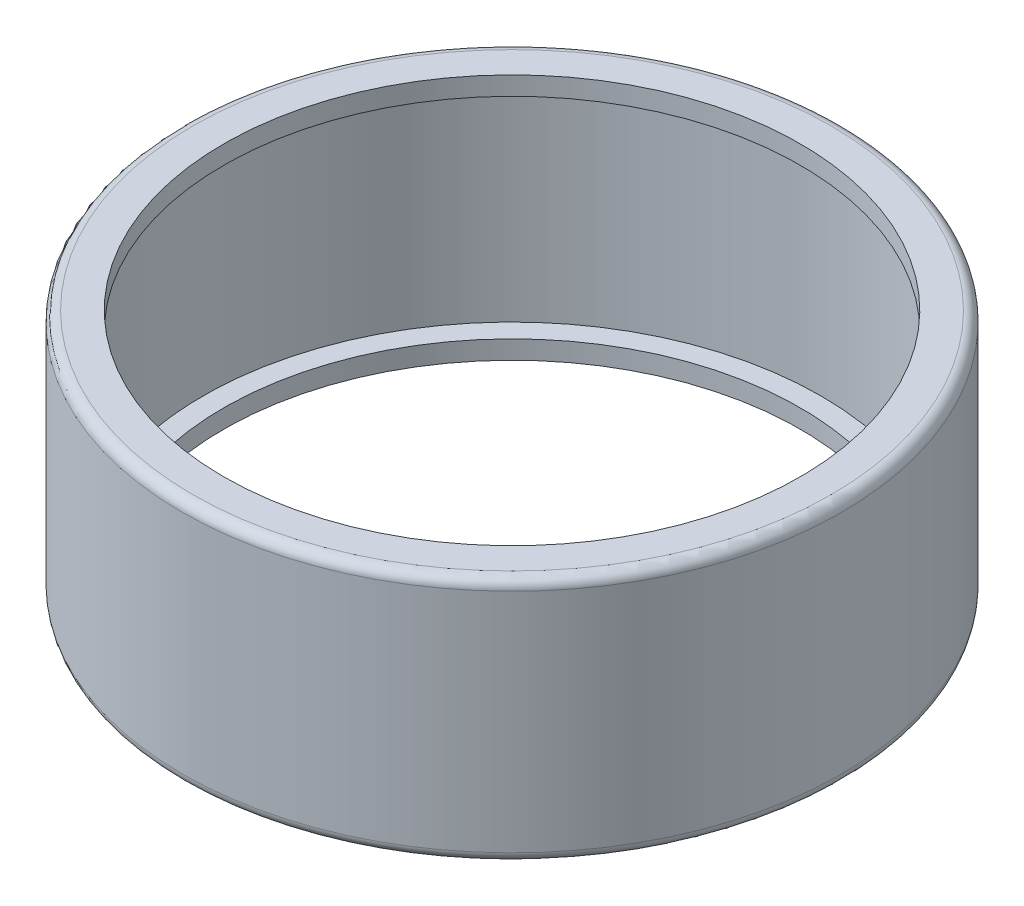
ISO-10303-21;
HEADER;
FILE_DESCRIPTION(('STEP AP214'),'2;1');
FILE_NAME('part.step','',(''),(''),'','','');
FILE_SCHEMA(('AUTOMOTIVE_DESIGN { 1 0 10303 214 1 1 1 1 }'));
ENDSEC;
DATA;
#1=APPLICATION_CONTEXT('core data for automotive mechanical design processes');
#2=APPLICATION_PROTOCOL_DEFINITION('international standard','automotive_design',2000,#1);
#3=PRODUCT_CONTEXT('',#1,'mechanical');
#4=PRODUCT('Part','Part','',(#3));
#5=PRODUCT_RELATED_PRODUCT_CATEGORY('part','',(#4));
#6=PRODUCT_DEFINITION_FORMATION('','',#4);
#7=PRODUCT_DEFINITION_CONTEXT('part definition',#1,'design');
#8=PRODUCT_DEFINITION('design','',#6,#7);
#9=PRODUCT_DEFINITION_SHAPE('','',#8);
#10=(LENGTH_UNIT() NAMED_UNIT(*) SI_UNIT(.MILLI.,.METRE.));
#11=(NAMED_UNIT(*) PLANE_ANGLE_UNIT() SI_UNIT($,.RADIAN.));
#12=(NAMED_UNIT(*) SI_UNIT($,.STERADIAN.) SOLID_ANGLE_UNIT());
#13=UNCERTAINTY_MEASURE_WITH_UNIT(LENGTH_MEASURE(1.E-05),#10,'distance_accuracy_value','');
#14=(GEOMETRIC_REPRESENTATION_CONTEXT(3) GLOBAL_UNCERTAINTY_ASSIGNED_CONTEXT((#13)) GLOBAL_UNIT_ASSIGNED_CONTEXT((#10,
#11,#12)) REPRESENTATION_CONTEXT('',''));
#15=CARTESIAN_POINT('',(0.,0.,0.));
#16=DIRECTION('',(0.,0.,1.));
#17=DIRECTION('',(1.,0.,0.));
#18=AXIS2_PLACEMENT_3D('',#15,#16,#17);
#19=CARTESIAN_POINT('',(-15.5,-6.,0.));
#20=DIRECTION('',(0.,-1.,0.));
#21=DIRECTION('',(0.,0.,-1.));
#22=AXIS2_PLACEMENT_3D('',#19,#20,#21);
#23=PLANE('',#22);
#24=CARTESIAN_POINT('',(0.,-6.,0.));
#25=DIRECTION('',(0.,1.,0.));
#26=DIRECTION('',(0.,0.,1.));
#27=AXIS2_PLACEMENT_3D('',#24,#25,#26);
#28=CIRCLE('',#27,14.);
#29=CARTESIAN_POINT('',(0.,-6.,14.));
#30=VERTEX_POINT('',#29);
#31=EDGE_CURVE('E11',#30,#30,#28,.T.);
#32=ORIENTED_EDGE('',*,*,#31,.T.);
#33=EDGE_LOOP('',(#32));
#34=FACE_BOUND('',#33,.T.);
#35=CARTESIAN_POINT('',(0.,-6.,0.));
#36=DIRECTION('',(0.,1.,0.));
#37=DIRECTION('',(0.,0.,1.));
#38=AXIS2_PLACEMENT_3D('',#35,#36,#37);
#39=CIRCLE('',#38,15.5);
#40=CARTESIAN_POINT('',(0.,-6.,15.5));
#41=VERTEX_POINT('',#40);
#42=EDGE_CURVE('E387',#41,#41,#39,.T.);
#43=ORIENTED_EDGE('',*,*,#42,.F.);
#44=EDGE_LOOP('',(#43));
#45=FACE_BOUND('',#44,.T.);
#46=ADVANCED_FACE('F352',(#34,#45),#23,.T.);
#47=CARTESIAN_POINT('',(0.,7.,0.));
#48=DIRECTION('',(0.,1.,0.));
#49=DIRECTION('',(0.,0.,1.));
#50=AXIS2_PLACEMENT_3D('',#47,#48,#49);
#51=CYLINDRICAL_SURFACE('',#50,14.);
#52=CARTESIAN_POINT('',(0.,-5.1,0.));
#53=DIRECTION('',(0.,1.,0.));
#54=DIRECTION('',(0.,0.,1.));
#55=AXIS2_PLACEMENT_3D('',#52,#53,#54);
#56=CIRCLE('',#55,14.);
#57=CARTESIAN_POINT('',(0.,-5.1,14.));
#58=VERTEX_POINT('',#57);
#59=EDGE_CURVE('E358',#58,#58,#56,.T.);
#60=ORIENTED_EDGE('',*,*,#59,.T.);
#61=EDGE_LOOP('',(#60));
#62=FACE_BOUND('',#61,.T.);
#63=ORIENTED_EDGE('',*,*,#31,.F.);
#64=EDGE_LOOP('',(#63));
#65=FACE_BOUND('',#64,.T.);
#66=ADVANCED_FACE('F396',(#62,#65),#51,.F.);
#67=CARTESIAN_POINT('',(-14.,-5.1,0.));
#68=DIRECTION('',(0.,1.,0.));
#69=DIRECTION('',(0.,0.,1.));
#70=AXIS2_PLACEMENT_3D('',#67,#68,#69);
#71=PLANE('',#70);
#72=CARTESIAN_POINT('',(0.,-5.1,0.));
#73=DIRECTION('',(0.,1.,0.));
#74=DIRECTION('',(0.,0.,1.));
#75=AXIS2_PLACEMENT_3D('',#72,#73,#74);
#76=CIRCLE('',#75,15.);
#77=CARTESIAN_POINT('',(0.,-5.1,15.));
#78=VERTEX_POINT('',#77);
#79=EDGE_CURVE('E362',#78,#78,#76,.T.);
#80=ORIENTED_EDGE('',*,*,#79,.T.);
#81=EDGE_LOOP('',(#80));
#82=FACE_BOUND('',#81,.T.);
#83=ORIENTED_EDGE('',*,*,#59,.F.);
#84=EDGE_LOOP('',(#83));
#85=FACE_BOUND('',#84,.T.);
#86=ADVANCED_FACE('F400',(#82,#85),#71,.T.);
#87=CARTESIAN_POINT('',(0.,7.,0.));
#88=DIRECTION('',(0.,1.,0.));
#89=DIRECTION('',(0.,0.,1.));
#90=AXIS2_PLACEMENT_3D('',#87,#88,#89);
#91=CYLINDRICAL_SURFACE('',#90,15.);
#92=CARTESIAN_POINT('',(0.,5.1,0.));
#93=DIRECTION('',(0.,1.,0.));
#94=DIRECTION('',(0.,0.,1.));
#95=AXIS2_PLACEMENT_3D('',#92,#93,#94);
#96=CIRCLE('',#95,15.);
#97=CARTESIAN_POINT('',(0.,5.1,15.));
#98=VERTEX_POINT('',#97);
#99=EDGE_CURVE('E366',#98,#98,#96,.T.);
#100=ORIENTED_EDGE('',*,*,#99,.T.);
#101=EDGE_LOOP('',(#100));
#102=FACE_BOUND('',#101,.T.);
#103=ORIENTED_EDGE('',*,*,#79,.F.);
#104=EDGE_LOOP('',(#103));
#105=FACE_BOUND('',#104,.T.);
#106=ADVANCED_FACE('F404',(#102,#105),#91,.F.);
#107=CARTESIAN_POINT('',(-15.,5.1,0.));
#108=DIRECTION('',(0.,-1.,0.));
#109=DIRECTION('',(0.,0.,-1.));
#110=AXIS2_PLACEMENT_3D('',#107,#108,#109);
#111=PLANE('',#110);
#112=CARTESIAN_POINT('',(0.,5.1,0.));
#113=DIRECTION('',(0.,1.,0.));
#114=DIRECTION('',(0.,0.,1.));
#115=AXIS2_PLACEMENT_3D('',#112,#113,#114);
#116=CIRCLE('',#115,14.);
#117=CARTESIAN_POINT('',(0.,5.1,14.));
#118=VERTEX_POINT('',#117);
#119=EDGE_CURVE('E371',#118,#118,#116,.T.);
#120=ORIENTED_EDGE('',*,*,#119,.T.);
#121=EDGE_LOOP('',(#120));
#122=FACE_BOUND('',#121,.T.);
#123=ORIENTED_EDGE('',*,*,#99,.F.);
#124=EDGE_LOOP('',(#123));
#125=FACE_BOUND('',#124,.T.);
#126=ADVANCED_FACE('F411',(#122,#125),#111,.T.);
#127=CARTESIAN_POINT('',(0.,7.,0.));
#128=DIRECTION('',(0.,1.,0.));
#129=DIRECTION('',(0.,0.,1.));
#130=AXIS2_PLACEMENT_3D('',#127,#128,#129);
#131=CYLINDRICAL_SURFACE('',#130,14.);
#132=CARTESIAN_POINT('',(0.,6.,0.));
#133=DIRECTION('',(0.,1.,0.));
#134=DIRECTION('',(0.,0.,1.));
#135=AXIS2_PLACEMENT_3D('',#132,#133,#134);
#136=CIRCLE('',#135,14.);
#137=CARTESIAN_POINT('',(0.,6.,14.));
#138=VERTEX_POINT('',#137);
#139=EDGE_CURVE('E374',#138,#138,#136,.T.);
#140=ORIENTED_EDGE('',*,*,#139,.T.);
#141=EDGE_LOOP('',(#140));
#142=FACE_BOUND('',#141,.T.);
#143=ORIENTED_EDGE('',*,*,#119,.F.);
#144=EDGE_LOOP('',(#143));
#145=FACE_BOUND('',#144,.T.);
#146=ADVANCED_FACE('F415',(#142,#145),#131,.F.);
#147=CARTESIAN_POINT('',(-14.,6.,0.));
#148=DIRECTION('',(0.,1.,0.));
#149=DIRECTION('',(0.,0.,1.));
#150=AXIS2_PLACEMENT_3D('',#147,#148,#149);
#151=PLANE('',#150);
#152=CARTESIAN_POINT('',(0.,6.,0.));
#153=DIRECTION('',(0.,1.,0.));
#154=DIRECTION('',(0.,0.,1.));
#155=AXIS2_PLACEMENT_3D('',#152,#153,#154);
#156=CIRCLE('',#155,15.5);
#157=CARTESIAN_POINT('',(0.,6.,15.5));
#158=VERTEX_POINT('',#157);
#159=EDGE_CURVE('E377',#158,#158,#156,.T.);
#160=ORIENTED_EDGE('',*,*,#159,.T.);
#161=EDGE_LOOP('',(#160));
#162=FACE_BOUND('',#161,.T.);
#163=ORIENTED_EDGE('',*,*,#139,.F.);
#164=EDGE_LOOP('',(#163));
#165=FACE_BOUND('',#164,.T.);
#166=ADVANCED_FACE('F419',(#162,#165),#151,.T.);
#167=CARTESIAN_POINT('',(0.,5.5,0.));
#168=DIRECTION('',(0.,1.,0.));
#169=DIRECTION('',(0.,0.,1.));
#170=AXIS2_PLACEMENT_3D('',#167,#168,#169);
#171=TOROIDAL_SURFACE('',#170,15.5,0.5);
#172=CARTESIAN_POINT('',(0.,5.5,0.));
#173=DIRECTION('',(0.,1.,0.));
#174=DIRECTION('',(0.,0.,1.));
#175=AXIS2_PLACEMENT_3D('',#172,#173,#174);
#176=CIRCLE('',#175,16.);
#177=CARTESIAN_POINT('',(0.,5.5,16.));
#178=VERTEX_POINT('',#177);
#179=EDGE_CURVE('E380',#178,#178,#176,.T.);
#180=ORIENTED_EDGE('',*,*,#179,.T.);
#181=EDGE_LOOP('',(#180));
#182=FACE_BOUND('',#181,.T.);
#183=ORIENTED_EDGE('',*,*,#159,.F.);
#184=EDGE_LOOP('',(#183));
#185=FACE_BOUND('',#184,.T.);
#186=ADVANCED_FACE('F423',(#182,#185),#171,.T.);
#187=CARTESIAN_POINT('',(0.,7.,0.));
#188=DIRECTION('',(0.,1.,0.));
#189=DIRECTION('',(0.,0.,1.));
#190=AXIS2_PLACEMENT_3D('',#187,#188,#189);
#191=CYLINDRICAL_SURFACE('',#190,16.);
#192=CARTESIAN_POINT('',(0.,-5.5,0.));
#193=DIRECTION('',(0.,1.,0.));
#194=DIRECTION('',(0.,0.,1.));
#195=AXIS2_PLACEMENT_3D('',#192,#193,#194);
#196=CIRCLE('',#195,16.);
#197=CARTESIAN_POINT('',(0.,-5.5,16.));
#198=VERTEX_POINT('',#197);
#199=EDGE_CURVE('E382',#198,#198,#196,.T.);
#200=ORIENTED_EDGE('',*,*,#199,.T.);
#201=EDGE_LOOP('',(#200));
#202=FACE_BOUND('',#201,.T.);
#203=ORIENTED_EDGE('',*,*,#179,.F.);
#204=EDGE_LOOP('',(#203));
#205=FACE_BOUND('',#204,.T.);
#206=ADVANCED_FACE('F427',(#202,#205),#191,.T.);
#207=CARTESIAN_POINT('',(0.,-5.5,0.));
#208=DIRECTION('',(0.,1.,0.));
#209=DIRECTION('',(0.,0.,1.));
#210=AXIS2_PLACEMENT_3D('',#207,#208,#209);
#211=TOROIDAL_SURFACE('',#210,15.5,0.500000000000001);
#212=ORIENTED_EDGE('',*,*,#42,.T.);
#213=EDGE_LOOP('',(#212));
#214=FACE_BOUND('',#213,.T.);
#215=ORIENTED_EDGE('',*,*,#199,.F.);
#216=EDGE_LOOP('',(#215));
#217=FACE_BOUND('',#216,.T.);
#218=ADVANCED_FACE('F392',(#214,#217),#211,.T.);
#219=CLOSED_SHELL('',(#46,#66,#86,#106,#126,#146,#166,#186,#206,#218));
#220=MANIFOLD_SOLID_BREP('B2',#219);
#221=ADVANCED_BREP_SHAPE_REPRESENTATION('',(#18,#220),#14);
#222=SHAPE_DEFINITION_REPRESENTATION(#9,#221);
ENDSEC;
END-ISO-10303-21;
